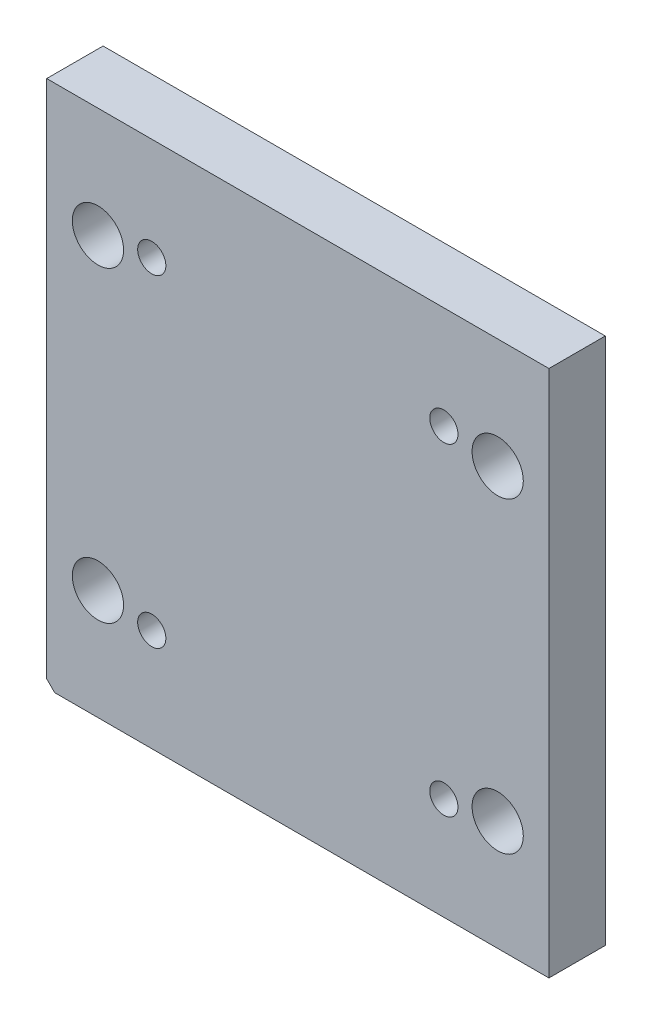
ISO-10303-21;
HEADER;
FILE_DESCRIPTION(('STEP AP214'),'2;1');
FILE_NAME('part.step','',(''),(''),'','','');
FILE_SCHEMA(('AUTOMOTIVE_DESIGN { 1 0 10303 214 1 1 1 1 }'));
ENDSEC;
DATA;
#1=APPLICATION_CONTEXT('core data for automotive mechanical design processes');
#2=APPLICATION_PROTOCOL_DEFINITION('international standard','automotive_design',2000,#1);
#3=PRODUCT_CONTEXT('',#1,'mechanical');
#4=PRODUCT('Part','Part','',(#3));
#5=PRODUCT_RELATED_PRODUCT_CATEGORY('part','',(#4));
#6=PRODUCT_DEFINITION_FORMATION('','',#4);
#7=PRODUCT_DEFINITION_CONTEXT('part definition',#1,'design');
#8=PRODUCT_DEFINITION('design','',#6,#7);
#9=PRODUCT_DEFINITION_SHAPE('','',#8);
#10=(LENGTH_UNIT() NAMED_UNIT(*) SI_UNIT(.MILLI.,.METRE.));
#11=(NAMED_UNIT(*) PLANE_ANGLE_UNIT() SI_UNIT($,.RADIAN.));
#12=(NAMED_UNIT(*) SI_UNIT($,.STERADIAN.) SOLID_ANGLE_UNIT());
#13=UNCERTAINTY_MEASURE_WITH_UNIT(LENGTH_MEASURE(1.E-05),#10,'distance_accuracy_value','');
#14=(GEOMETRIC_REPRESENTATION_CONTEXT(3) GLOBAL_UNCERTAINTY_ASSIGNED_CONTEXT((#13)) GLOBAL_UNIT_ASSIGNED_CONTEXT((#10,
#11,#12)) REPRESENTATION_CONTEXT('',''));
#15=CARTESIAN_POINT('',(0.,0.,0.));
#16=DIRECTION('',(0.,0.,1.));
#17=DIRECTION('',(1.,0.,0.));
#18=AXIS2_PLACEMENT_3D('',#15,#16,#17);
#19=CARTESIAN_POINT('',(-98.,-103.,-306.344861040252));
#20=DIRECTION('',(-1.,0.,0.));
#21=DIRECTION('',(0.,0.,1.));
#22=AXIS2_PLACEMENT_3D('',#19,#20,#21);
#23=PLANE('',#22);
#24=DIRECTION('',(0.,1.,0.));
#25=VECTOR('',#24,1.);
#26=CARTESIAN_POINT('',(-98.,-103.,-22.));
#27=LINE('',#26,#25);
#28=CARTESIAN_POINT('',(-98.,-99.88,-22.));
#29=VERTEX_POINT('',#28);
#30=CARTESIAN_POINT('',(-98.,103.,-22.));
#31=VERTEX_POINT('',#30);
#32=EDGE_CURVE('E108',#29,#31,#27,.T.);
#33=ORIENTED_EDGE('',*,*,#32,.F.);
#34=DIRECTION('',(0.,0.,1.));
#35=VECTOR('',#34,1.);
#36=CARTESIAN_POINT('',(-98.,-99.88,-306.344861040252));
#37=LINE('',#36,#35);
#38=CARTESIAN_POINT('',(-98.,-99.88,0.));
#39=VERTEX_POINT('',#38);
#40=EDGE_CURVE('E107',#29,#39,#37,.T.);
#41=ORIENTED_EDGE('',*,*,#40,.T.);
#42=DIRECTION('',(0.,-1.,0.));
#43=VECTOR('',#42,1.);
#44=CARTESIAN_POINT('',(-98.,-103.,0.));
#45=LINE('',#44,#43);
#46=CARTESIAN_POINT('',(-98.,103.,0.));
#47=VERTEX_POINT('',#46);
#48=EDGE_CURVE('E85',#47,#39,#45,.T.);
#49=ORIENTED_EDGE('',*,*,#48,.F.);
#50=DIRECTION('',(0.,0.,1.));
#51=VECTOR('',#50,1.);
#52=CARTESIAN_POINT('',(-98.,103.,-306.344861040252));
#53=LINE('',#52,#51);
#54=EDGE_CURVE('E102',#31,#47,#53,.T.);
#55=ORIENTED_EDGE('',*,*,#54,.F.);
#56=EDGE_LOOP('',(#33,#41,#49,#55));
#57=FACE_BOUND('',#56,.T.);
#58=ADVANCED_FACE('F34',(#57),#23,.T.);
#59=CARTESIAN_POINT('',(-98.,103.,-306.344861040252));
#60=DIRECTION('',(0.,1.,0.));
#61=DIRECTION('',(-1.,0.,0.));
#62=AXIS2_PLACEMENT_3D('',#59,#60,#61);
#63=PLANE('',#62);
#64=DIRECTION('',(1.,0.,0.));
#65=VECTOR('',#64,1.);
#66=CARTESIAN_POINT('',(-98.,103.,-22.));
#67=LINE('',#66,#65);
#68=CARTESIAN_POINT('',(98.,103.,-22.));
#69=VERTEX_POINT('',#68);
#70=EDGE_CURVE('E124',#31,#69,#67,.T.);
#71=ORIENTED_EDGE('',*,*,#70,.F.);
#72=ORIENTED_EDGE('',*,*,#54,.T.);
#73=DIRECTION('',(-1.,0.,0.));
#74=VECTOR('',#73,1.);
#75=CARTESIAN_POINT('',(-98.,103.,0.));
#76=LINE('',#75,#74);
#77=CARTESIAN_POINT('',(98.,103.,0.));
#78=VERTEX_POINT('',#77);
#79=EDGE_CURVE('E94',#78,#47,#76,.T.);
#80=ORIENTED_EDGE('',*,*,#79,.F.);
#81=DIRECTION('',(0.,0.,1.));
#82=VECTOR('',#81,1.);
#83=CARTESIAN_POINT('',(98.,103.,-306.344861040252));
#84=LINE('',#83,#82);
#85=EDGE_CURVE('E93',#69,#78,#84,.T.);
#86=ORIENTED_EDGE('',*,*,#85,.F.);
#87=EDGE_LOOP('',(#71,#72,#80,#86));
#88=FACE_BOUND('',#87,.T.);
#89=ADVANCED_FACE('F225',(#88),#63,.T.);
#90=CARTESIAN_POINT('',(98.,-103.,-306.344861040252));
#91=DIRECTION('',(1.,0.,0.));
#92=DIRECTION('',(0.,1.,0.));
#93=AXIS2_PLACEMENT_3D('',#90,#91,#92);
#94=PLANE('',#93);
#95=DIRECTION('',(0.,-1.,0.));
#96=VECTOR('',#95,1.);
#97=CARTESIAN_POINT('',(98.,-103.,-22.));
#98=LINE('',#97,#96);
#99=CARTESIAN_POINT('',(98.,-103.,-22.));
#100=VERTEX_POINT('',#99);
#101=EDGE_CURVE('E104',#69,#100,#98,.T.);
#102=ORIENTED_EDGE('',*,*,#101,.F.);
#103=ORIENTED_EDGE('',*,*,#85,.T.);
#104=DIRECTION('',(0.,1.,0.));
#105=VECTOR('',#104,1.);
#106=CARTESIAN_POINT('',(98.,-103.,0.));
#107=LINE('',#106,#105);
#108=CARTESIAN_POINT('',(98.,-103.,0.));
#109=VERTEX_POINT('',#108);
#110=EDGE_CURVE('E83',#109,#78,#107,.T.);
#111=ORIENTED_EDGE('',*,*,#110,.F.);
#112=DIRECTION('',(0.,0.,1.));
#113=VECTOR('',#112,1.);
#114=CARTESIAN_POINT('',(98.,-103.,-306.344861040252));
#115=LINE('',#114,#113);
#116=EDGE_CURVE('E88',#100,#109,#115,.T.);
#117=ORIENTED_EDGE('',*,*,#116,.F.);
#118=EDGE_LOOP('',(#102,#103,#111,#117));
#119=FACE_BOUND('',#118,.T.);
#120=ADVANCED_FACE('F96',(#119),#94,.T.);
#121=CARTESIAN_POINT('',(-98.,-103.,-306.344861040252));
#122=DIRECTION('',(0.,-1.,0.));
#123=DIRECTION('',(1.,0.,0.));
#124=AXIS2_PLACEMENT_3D('',#121,#122,#123);
#125=PLANE('',#124);
#126=DIRECTION('',(1.,0.,0.));
#127=VECTOR('',#126,1.);
#128=CARTESIAN_POINT('',(-98.,-103.,0.));
#129=LINE('',#128,#127);
#130=CARTESIAN_POINT('',(-94.88,-103.,0.));
#131=VERTEX_POINT('',#130);
#132=EDGE_CURVE('E78',#131,#109,#129,.T.);
#133=ORIENTED_EDGE('',*,*,#132,.F.);
#134=DIRECTION('',(0.,0.,-1.));
#135=VECTOR('',#134,1.);
#136=CARTESIAN_POINT('',(-94.88,-103.,-306.344861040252));
#137=LINE('',#136,#135);
#138=CARTESIAN_POINT('',(-94.88,-103.,-22.));
#139=VERTEX_POINT('',#138);
#140=EDGE_CURVE('E42',#131,#139,#137,.T.);
#141=ORIENTED_EDGE('',*,*,#140,.T.);
#142=DIRECTION('',(-1.,0.,0.));
#143=VECTOR('',#142,1.);
#144=CARTESIAN_POINT('',(-98.,-103.,-22.));
#145=LINE('',#144,#143);
#146=EDGE_CURVE('E90',#100,#139,#145,.T.);
#147=ORIENTED_EDGE('',*,*,#146,.F.);
#148=ORIENTED_EDGE('',*,*,#116,.T.);
#149=EDGE_LOOP('',(#133,#141,#147,#148));
#150=FACE_BOUND('',#149,.T.);
#151=ADVANCED_FACE('F89',(#150),#125,.T.);
#152=CARTESIAN_POINT('',(0.,0.,0.));
#153=DIRECTION('',(0.,0.,-1.));
#154=DIRECTION('',(-1.,0.,0.));
#155=AXIS2_PLACEMENT_3D('',#152,#153,#154);
#156=PLANE('',#155);
#157=CARTESIAN_POINT('',(-57.,-63.,0.));
#158=DIRECTION('',(0.,0.,-1.));
#159=DIRECTION('',(-1.,0.,0.));
#160=AXIS2_PLACEMENT_3D('',#157,#158,#159);
#161=CIRCLE('',#160,5.5);
#162=CARTESIAN_POINT('',(-62.5,-63.,0.));
#163=VERTEX_POINT('',#162);
#164=EDGE_CURVE('E183',#163,#163,#161,.T.);
#165=ORIENTED_EDGE('',*,*,#164,.T.);
#166=EDGE_LOOP('',(#165));
#167=FACE_BOUND('',#166,.T.);
#168=CARTESIAN_POINT('',(-57.,63.,0.));
#169=DIRECTION('',(0.,0.,-1.));
#170=DIRECTION('',(-1.,0.,0.));
#171=AXIS2_PLACEMENT_3D('',#168,#169,#170);
#172=CIRCLE('',#171,5.5);
#173=CARTESIAN_POINT('',(-62.5,63.,0.));
#174=VERTEX_POINT('',#173);
#175=EDGE_CURVE('E171',#174,#174,#172,.T.);
#176=ORIENTED_EDGE('',*,*,#175,.T.);
#177=EDGE_LOOP('',(#176));
#178=FACE_BOUND('',#177,.T.);
#179=CARTESIAN_POINT('',(57.,63.,0.));
#180=DIRECTION('',(0.,0.,-1.));
#181=DIRECTION('',(-1.,0.,0.));
#182=AXIS2_PLACEMENT_3D('',#179,#180,#181);
#183=CIRCLE('',#182,5.5);
#184=CARTESIAN_POINT('',(51.5,63.,0.));
#185=VERTEX_POINT('',#184);
#186=EDGE_CURVE('E159',#185,#185,#183,.T.);
#187=ORIENTED_EDGE('',*,*,#186,.T.);
#188=EDGE_LOOP('',(#187));
#189=FACE_BOUND('',#188,.T.);
#190=CARTESIAN_POINT('',(57.,-63.,0.));
#191=DIRECTION('',(0.,0.,-1.));
#192=DIRECTION('',(-1.,0.,0.));
#193=AXIS2_PLACEMENT_3D('',#190,#191,#192);
#194=CIRCLE('',#193,5.50000000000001);
#195=CARTESIAN_POINT('',(51.5,-63.,0.));
#196=VERTEX_POINT('',#195);
#197=EDGE_CURVE('E147',#196,#196,#194,.T.);
#198=ORIENTED_EDGE('',*,*,#197,.T.);
#199=EDGE_LOOP('',(#198));
#200=FACE_BOUND('',#199,.T.);
#201=CARTESIAN_POINT('',(-78.,-60.,0.));
#202=DIRECTION('',(0.,0.,1.));
#203=DIRECTION('',(1.,0.,0.));
#204=AXIS2_PLACEMENT_3D('',#201,#202,#203);
#205=CIRCLE('',#204,9.99999999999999);
#206=CARTESIAN_POINT('',(-68.,-60.,0.));
#207=VERTEX_POINT('',#206);
#208=EDGE_CURVE('E144',#207,#207,#205,.T.);
#209=ORIENTED_EDGE('',*,*,#208,.F.);
#210=EDGE_LOOP('',(#209));
#211=FACE_BOUND('',#210,.T.);
#212=CARTESIAN_POINT('',(-78.,60.,0.));
#213=DIRECTION('',(0.,0.,1.));
#214=DIRECTION('',(1.,0.,0.));
#215=AXIS2_PLACEMENT_3D('',#212,#213,#214);
#216=CIRCLE('',#215,9.99999999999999);
#217=CARTESIAN_POINT('',(-68.,60.,0.));
#218=VERTEX_POINT('',#217);
#219=EDGE_CURVE('E138',#218,#218,#216,.T.);
#220=ORIENTED_EDGE('',*,*,#219,.F.);
#221=EDGE_LOOP('',(#220));
#222=FACE_BOUND('',#221,.T.);
#223=CARTESIAN_POINT('',(78.,60.,0.));
#224=DIRECTION('',(0.,0.,1.));
#225=DIRECTION('',(1.,0.,0.));
#226=AXIS2_PLACEMENT_3D('',#223,#224,#225);
#227=CIRCLE('',#226,9.99999999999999);
#228=CARTESIAN_POINT('',(88.,60.,0.));
#229=VERTEX_POINT('',#228);
#230=EDGE_CURVE('E132',#229,#229,#227,.T.);
#231=ORIENTED_EDGE('',*,*,#230,.F.);
#232=EDGE_LOOP('',(#231));
#233=FACE_BOUND('',#232,.T.);
#234=CARTESIAN_POINT('',(78.,-60.,0.));
#235=DIRECTION('',(0.,0.,1.));
#236=DIRECTION('',(1.,0.,0.));
#237=AXIS2_PLACEMENT_3D('',#234,#235,#236);
#238=CIRCLE('',#237,9.99999999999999);
#239=CARTESIAN_POINT('',(88.,-60.,0.));
#240=VERTEX_POINT('',#239);
#241=EDGE_CURVE('E120',#240,#240,#238,.T.);
#242=ORIENTED_EDGE('',*,*,#241,.F.);
#243=EDGE_LOOP('',(#242));
#244=FACE_BOUND('',#243,.T.);
#245=ORIENTED_EDGE('',*,*,#48,.T.);
#246=DIRECTION('',(-0.707106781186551,0.707106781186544,0.));
#247=VECTOR('',#246,1.);
#248=CARTESIAN_POINT('',(-98.,-99.88,0.));
#249=LINE('',#248,#247);
#250=EDGE_CURVE('E56',#39,#131,#249,.F.);
#251=ORIENTED_EDGE('',*,*,#250,.T.);
#252=ORIENTED_EDGE('',*,*,#132,.T.);
#253=ORIENTED_EDGE('',*,*,#110,.T.);
#254=ORIENTED_EDGE('',*,*,#79,.T.);
#255=EDGE_LOOP('',(#245,#251,#252,#253,#254));
#256=FACE_BOUND('',#255,.T.);
#257=ADVANCED_FACE('F80',(#167,#178,#189,#200,#211,#222,#233,#244,#256),#156,.F.);
#258=CARTESIAN_POINT('',(0.,0.,-22.));
#259=DIRECTION('',(0.,0.,1.));
#260=DIRECTION('',(1.,0.,0.));
#261=AXIS2_PLACEMENT_3D('',#258,#259,#260);
#262=PLANE('',#261);
#263=CARTESIAN_POINT('',(-57.,-63.,-22.));
#264=DIRECTION('',(0.,0.,-1.));
#265=DIRECTION('',(-1.,0.,0.));
#266=AXIS2_PLACEMENT_3D('',#263,#264,#265);
#267=CIRCLE('',#266,9.);
#268=CARTESIAN_POINT('',(-66.,-63.,-22.));
#269=VERTEX_POINT('',#268);
#270=EDGE_CURVE('E192',#269,#269,#267,.T.);
#271=ORIENTED_EDGE('',*,*,#270,.F.);
#272=EDGE_LOOP('',(#271));
#273=FACE_BOUND('',#272,.T.);
#274=CARTESIAN_POINT('',(-57.,63.,-22.));
#275=DIRECTION('',(0.,0.,-1.));
#276=DIRECTION('',(-1.,0.,0.));
#277=AXIS2_PLACEMENT_3D('',#274,#275,#276);
#278=CIRCLE('',#277,9.);
#279=CARTESIAN_POINT('',(-66.,63.,-22.));
#280=VERTEX_POINT('',#279);
#281=EDGE_CURVE('E180',#280,#280,#278,.T.);
#282=ORIENTED_EDGE('',*,*,#281,.F.);
#283=EDGE_LOOP('',(#282));
#284=FACE_BOUND('',#283,.T.);
#285=CARTESIAN_POINT('',(57.,63.,-22.));
#286=DIRECTION('',(0.,0.,-1.));
#287=DIRECTION('',(-1.,0.,0.));
#288=AXIS2_PLACEMENT_3D('',#285,#286,#287);
#289=CIRCLE('',#288,9.00000000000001);
#290=CARTESIAN_POINT('',(48.,63.,-22.));
#291=VERTEX_POINT('',#290);
#292=EDGE_CURVE('E168',#291,#291,#289,.T.);
#293=ORIENTED_EDGE('',*,*,#292,.F.);
#294=EDGE_LOOP('',(#293));
#295=FACE_BOUND('',#294,.T.);
#296=CARTESIAN_POINT('',(57.,-63.,-22.));
#297=DIRECTION('',(0.,0.,-1.));
#298=DIRECTION('',(-1.,0.,0.));
#299=AXIS2_PLACEMENT_3D('',#296,#297,#298);
#300=CIRCLE('',#299,9.00000000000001);
#301=CARTESIAN_POINT('',(48.,-63.,-22.));
#302=VERTEX_POINT('',#301);
#303=EDGE_CURVE('E156',#302,#302,#300,.T.);
#304=ORIENTED_EDGE('',*,*,#303,.F.);
#305=EDGE_LOOP('',(#304));
#306=FACE_BOUND('',#305,.T.);
#307=CARTESIAN_POINT('',(-78.,-60.,-22.));
#308=DIRECTION('',(0.,0.,1.));
#309=DIRECTION('',(1.,0.,0.));
#310=AXIS2_PLACEMENT_3D('',#307,#308,#309);
#311=CIRCLE('',#310,9.99999999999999);
#312=CARTESIAN_POINT('',(-68.,-60.,-22.));
#313=VERTEX_POINT('',#312);
#314=EDGE_CURVE('E141',#313,#313,#311,.T.);
#315=ORIENTED_EDGE('',*,*,#314,.T.);
#316=EDGE_LOOP('',(#315));
#317=FACE_BOUND('',#316,.T.);
#318=CARTESIAN_POINT('',(-78.,60.,-22.));
#319=DIRECTION('',(0.,0.,1.));
#320=DIRECTION('',(1.,0.,0.));
#321=AXIS2_PLACEMENT_3D('',#318,#319,#320);
#322=CIRCLE('',#321,9.99999999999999);
#323=CARTESIAN_POINT('',(-68.,60.,-22.));
#324=VERTEX_POINT('',#323);
#325=EDGE_CURVE('E135',#324,#324,#322,.T.);
#326=ORIENTED_EDGE('',*,*,#325,.T.);
#327=EDGE_LOOP('',(#326));
#328=FACE_BOUND('',#327,.T.);
#329=CARTESIAN_POINT('',(78.,60.,-22.));
#330=DIRECTION('',(0.,0.,1.));
#331=DIRECTION('',(1.,0.,0.));
#332=AXIS2_PLACEMENT_3D('',#329,#330,#331);
#333=CIRCLE('',#332,9.99999999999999);
#334=CARTESIAN_POINT('',(88.,60.,-22.));
#335=VERTEX_POINT('',#334);
#336=EDGE_CURVE('E129',#335,#335,#333,.T.);
#337=ORIENTED_EDGE('',*,*,#336,.T.);
#338=EDGE_LOOP('',(#337));
#339=FACE_BOUND('',#338,.T.);
#340=CARTESIAN_POINT('',(78.,-60.,-22.));
#341=DIRECTION('',(0.,0.,1.));
#342=DIRECTION('',(1.,0.,0.));
#343=AXIS2_PLACEMENT_3D('',#340,#341,#342);
#344=CIRCLE('',#343,9.99999999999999);
#345=CARTESIAN_POINT('',(88.,-60.,-22.));
#346=VERTEX_POINT('',#345);
#347=EDGE_CURVE('E118',#346,#346,#344,.T.);
#348=ORIENTED_EDGE('',*,*,#347,.T.);
#349=EDGE_LOOP('',(#348));
#350=FACE_BOUND('',#349,.T.);
#351=ORIENTED_EDGE('',*,*,#146,.T.);
#352=DIRECTION('',(0.707106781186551,-0.707106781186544,0.));
#353=VECTOR('',#352,1.);
#354=CARTESIAN_POINT('',(-98.,-99.88,-22.));
#355=LINE('',#354,#353);
#356=EDGE_CURVE('E11',#139,#29,#355,.F.);
#357=ORIENTED_EDGE('',*,*,#356,.T.);
#358=ORIENTED_EDGE('',*,*,#32,.T.);
#359=ORIENTED_EDGE('',*,*,#70,.T.);
#360=ORIENTED_EDGE('',*,*,#101,.T.);
#361=EDGE_LOOP('',(#351,#357,#358,#359,#360));
#362=FACE_BOUND('',#361,.T.);
#363=ADVANCED_FACE('F198',(#273,#284,#295,#306,#317,#328,#339,#350,#362),#262,.F.);
#364=CARTESIAN_POINT('',(78.,-60.,0.));
#365=DIRECTION('',(0.,0.,1.));
#366=DIRECTION('',(1.,0.,0.));
#367=AXIS2_PLACEMENT_3D('',#364,#365,#366);
#368=CYLINDRICAL_SURFACE('',#367,9.99999999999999);
#369=ORIENTED_EDGE('',*,*,#347,.F.);
#370=EDGE_LOOP('',(#369));
#371=FACE_BOUND('',#370,.T.);
#372=ORIENTED_EDGE('',*,*,#241,.T.);
#373=EDGE_LOOP('',(#372));
#374=FACE_BOUND('',#373,.T.);
#375=ADVANCED_FACE('F201',(#371,#374),#368,.F.);
#376=CARTESIAN_POINT('',(78.,60.,0.));
#377=DIRECTION('',(0.,0.,1.));
#378=DIRECTION('',(1.,0.,0.));
#379=AXIS2_PLACEMENT_3D('',#376,#377,#378);
#380=CYLINDRICAL_SURFACE('',#379,9.99999999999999);
#381=ORIENTED_EDGE('',*,*,#336,.F.);
#382=EDGE_LOOP('',(#381));
#383=FACE_BOUND('',#382,.T.);
#384=ORIENTED_EDGE('',*,*,#230,.T.);
#385=EDGE_LOOP('',(#384));
#386=FACE_BOUND('',#385,.T.);
#387=ADVANCED_FACE('F241',(#383,#386),#380,.F.);
#388=CARTESIAN_POINT('',(-78.,60.,0.));
#389=DIRECTION('',(0.,0.,1.));
#390=DIRECTION('',(1.,0.,0.));
#391=AXIS2_PLACEMENT_3D('',#388,#389,#390);
#392=CYLINDRICAL_SURFACE('',#391,9.99999999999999);
#393=ORIENTED_EDGE('',*,*,#325,.F.);
#394=EDGE_LOOP('',(#393));
#395=FACE_BOUND('',#394,.T.);
#396=ORIENTED_EDGE('',*,*,#219,.T.);
#397=EDGE_LOOP('',(#396));
#398=FACE_BOUND('',#397,.T.);
#399=ADVANCED_FACE('F245',(#395,#398),#392,.F.);
#400=CARTESIAN_POINT('',(-78.,-60.,0.));
#401=DIRECTION('',(0.,0.,1.));
#402=DIRECTION('',(1.,0.,0.));
#403=AXIS2_PLACEMENT_3D('',#400,#401,#402);
#404=CYLINDRICAL_SURFACE('',#403,9.99999999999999);
#405=ORIENTED_EDGE('',*,*,#314,.F.);
#406=EDGE_LOOP('',(#405));
#407=FACE_BOUND('',#406,.T.);
#408=ORIENTED_EDGE('',*,*,#208,.T.);
#409=EDGE_LOOP('',(#408));
#410=FACE_BOUND('',#409,.T.);
#411=ADVANCED_FACE('F249',(#407,#410),#404,.F.);
#412=CARTESIAN_POINT('',(57.,-63.,-22.));
#413=DIRECTION('',(0.,0.,-1.));
#414=DIRECTION('',(-1.,0.,0.));
#415=AXIS2_PLACEMENT_3D('',#412,#413,#414);
#416=CYLINDRICAL_SURFACE('',#415,5.50000000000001);
#417=ORIENTED_EDGE('',*,*,#197,.F.);
#418=EDGE_LOOP('',(#417));
#419=FACE_BOUND('',#418,.T.);
#420=CARTESIAN_POINT('',(57.,-63.,-9.));
#421=DIRECTION('',(0.,0.,-1.));
#422=DIRECTION('',(-1.,0.,0.));
#423=AXIS2_PLACEMENT_3D('',#420,#421,#422);
#424=CIRCLE('',#423,5.50000000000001);
#425=CARTESIAN_POINT('',(51.5,-63.,-9.));
#426=VERTEX_POINT('',#425);
#427=EDGE_CURVE('E150',#426,#426,#424,.T.);
#428=ORIENTED_EDGE('',*,*,#427,.T.);
#429=EDGE_LOOP('',(#428));
#430=FACE_BOUND('',#429,.T.);
#431=ADVANCED_FACE('F253',(#419,#430),#416,.F.);
#432=CARTESIAN_POINT('',(62.5,-63.,-9.));
#433=DIRECTION('',(0.,0.,1.));
#434=DIRECTION('',(1.,0.,0.));
#435=AXIS2_PLACEMENT_3D('',#432,#433,#434);
#436=PLANE('',#435);
#437=ORIENTED_EDGE('',*,*,#427,.F.);
#438=EDGE_LOOP('',(#437));
#439=FACE_BOUND('',#438,.T.);
#440=CARTESIAN_POINT('',(57.,-63.,-9.));
#441=DIRECTION('',(0.,0.,-1.));
#442=DIRECTION('',(-1.,0.,0.));
#443=AXIS2_PLACEMENT_3D('',#440,#441,#442);
#444=CIRCLE('',#443,8.99999999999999);
#445=CARTESIAN_POINT('',(48.,-63.,-9.));
#446=VERTEX_POINT('',#445);
#447=EDGE_CURVE('E153',#446,#446,#444,.T.);
#448=ORIENTED_EDGE('',*,*,#447,.T.);
#449=EDGE_LOOP('',(#448));
#450=FACE_BOUND('',#449,.T.);
#451=ADVANCED_FACE('F257',(#439,#450),#436,.F.);
#452=CARTESIAN_POINT('',(57.,-63.,-22.));
#453=DIRECTION('',(0.,0.,-1.));
#454=DIRECTION('',(-1.,0.,0.));
#455=AXIS2_PLACEMENT_3D('',#452,#453,#454);
#456=CYLINDRICAL_SURFACE('',#455,9.);
#457=ORIENTED_EDGE('',*,*,#447,.F.);
#458=EDGE_LOOP('',(#457));
#459=FACE_BOUND('',#458,.T.);
#460=ORIENTED_EDGE('',*,*,#303,.T.);
#461=EDGE_LOOP('',(#460));
#462=FACE_BOUND('',#461,.T.);
#463=ADVANCED_FACE('F261',(#459,#462),#456,.F.);
#464=CARTESIAN_POINT('',(57.,63.,-22.));
#465=DIRECTION('',(0.,0.,-1.));
#466=DIRECTION('',(-1.,0.,0.));
#467=AXIS2_PLACEMENT_3D('',#464,#465,#466);
#468=CYLINDRICAL_SURFACE('',#467,5.5);
#469=ORIENTED_EDGE('',*,*,#186,.F.);
#470=EDGE_LOOP('',(#469));
#471=FACE_BOUND('',#470,.T.);
#472=CARTESIAN_POINT('',(57.,63.,-9.));
#473=DIRECTION('',(0.,0.,-1.));
#474=DIRECTION('',(-1.,0.,0.));
#475=AXIS2_PLACEMENT_3D('',#472,#473,#474);
#476=CIRCLE('',#475,5.5);
#477=CARTESIAN_POINT('',(51.5,63.,-9.));
#478=VERTEX_POINT('',#477);
#479=EDGE_CURVE('E162',#478,#478,#476,.T.);
#480=ORIENTED_EDGE('',*,*,#479,.T.);
#481=EDGE_LOOP('',(#480));
#482=FACE_BOUND('',#481,.T.);
#483=ADVANCED_FACE('F265',(#471,#482),#468,.F.);
#484=CARTESIAN_POINT('',(62.5,63.,-9.));
#485=DIRECTION('',(0.,0.,1.));
#486=DIRECTION('',(1.,0.,0.));
#487=AXIS2_PLACEMENT_3D('',#484,#485,#486);
#488=PLANE('',#487);
#489=ORIENTED_EDGE('',*,*,#479,.F.);
#490=EDGE_LOOP('',(#489));
#491=FACE_BOUND('',#490,.T.);
#492=CARTESIAN_POINT('',(57.,63.,-9.));
#493=DIRECTION('',(0.,0.,-1.));
#494=DIRECTION('',(-1.,0.,0.));
#495=AXIS2_PLACEMENT_3D('',#492,#493,#494);
#496=CIRCLE('',#495,9.00000000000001);
#497=CARTESIAN_POINT('',(48.,63.,-9.));
#498=VERTEX_POINT('',#497);
#499=EDGE_CURVE('E165',#498,#498,#496,.T.);
#500=ORIENTED_EDGE('',*,*,#499,.T.);
#501=EDGE_LOOP('',(#500));
#502=FACE_BOUND('',#501,.T.);
#503=ADVANCED_FACE('F269',(#491,#502),#488,.F.);
#504=CARTESIAN_POINT('',(57.,63.,-22.));
#505=DIRECTION('',(0.,0.,-1.));
#506=DIRECTION('',(-1.,0.,0.));
#507=AXIS2_PLACEMENT_3D('',#504,#505,#506);
#508=CYLINDRICAL_SURFACE('',#507,9.00000000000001);
#509=ORIENTED_EDGE('',*,*,#499,.F.);
#510=EDGE_LOOP('',(#509));
#511=FACE_BOUND('',#510,.T.);
#512=ORIENTED_EDGE('',*,*,#292,.T.);
#513=EDGE_LOOP('',(#512));
#514=FACE_BOUND('',#513,.T.);
#515=ADVANCED_FACE('F273',(#511,#514),#508,.F.);
#516=CARTESIAN_POINT('',(-57.,63.,-22.));
#517=DIRECTION('',(0.,0.,-1.));
#518=DIRECTION('',(-1.,0.,0.));
#519=AXIS2_PLACEMENT_3D('',#516,#517,#518);
#520=CYLINDRICAL_SURFACE('',#519,5.5);
#521=ORIENTED_EDGE('',*,*,#175,.F.);
#522=EDGE_LOOP('',(#521));
#523=FACE_BOUND('',#522,.T.);
#524=CARTESIAN_POINT('',(-57.,63.,-9.));
#525=DIRECTION('',(0.,0.,-1.));
#526=DIRECTION('',(-1.,0.,0.));
#527=AXIS2_PLACEMENT_3D('',#524,#525,#526);
#528=CIRCLE('',#527,5.5);
#529=CARTESIAN_POINT('',(-62.5,63.,-9.));
#530=VERTEX_POINT('',#529);
#531=EDGE_CURVE('E174',#530,#530,#528,.T.);
#532=ORIENTED_EDGE('',*,*,#531,.T.);
#533=EDGE_LOOP('',(#532));
#534=FACE_BOUND('',#533,.T.);
#535=ADVANCED_FACE('F277',(#523,#534),#520,.F.);
#536=CARTESIAN_POINT('',(-51.5,63.,-9.));
#537=DIRECTION('',(0.,0.,1.));
#538=DIRECTION('',(1.,0.,0.));
#539=AXIS2_PLACEMENT_3D('',#536,#537,#538);
#540=PLANE('',#539);
#541=ORIENTED_EDGE('',*,*,#531,.F.);
#542=EDGE_LOOP('',(#541));
#543=FACE_BOUND('',#542,.T.);
#544=CARTESIAN_POINT('',(-57.,63.,-9.));
#545=DIRECTION('',(0.,0.,-1.));
#546=DIRECTION('',(-1.,0.,0.));
#547=AXIS2_PLACEMENT_3D('',#544,#545,#546);
#548=CIRCLE('',#547,9.);
#549=CARTESIAN_POINT('',(-66.,63.,-9.));
#550=VERTEX_POINT('',#549);
#551=EDGE_CURVE('E177',#550,#550,#548,.T.);
#552=ORIENTED_EDGE('',*,*,#551,.T.);
#553=EDGE_LOOP('',(#552));
#554=FACE_BOUND('',#553,.T.);
#555=ADVANCED_FACE('F281',(#543,#554),#540,.F.);
#556=CARTESIAN_POINT('',(-57.,63.,-22.));
#557=DIRECTION('',(0.,0.,-1.));
#558=DIRECTION('',(-1.,0.,0.));
#559=AXIS2_PLACEMENT_3D('',#556,#557,#558);
#560=CYLINDRICAL_SURFACE('',#559,9.);
#561=ORIENTED_EDGE('',*,*,#551,.F.);
#562=EDGE_LOOP('',(#561));
#563=FACE_BOUND('',#562,.T.);
#564=ORIENTED_EDGE('',*,*,#281,.T.);
#565=EDGE_LOOP('',(#564));
#566=FACE_BOUND('',#565,.T.);
#567=ADVANCED_FACE('F285',(#563,#566),#560,.F.);
#568=CARTESIAN_POINT('',(-57.,-63.,-22.));
#569=DIRECTION('',(0.,0.,-1.));
#570=DIRECTION('',(-1.,0.,0.));
#571=AXIS2_PLACEMENT_3D('',#568,#569,#570);
#572=CYLINDRICAL_SURFACE('',#571,5.5);
#573=ORIENTED_EDGE('',*,*,#164,.F.);
#574=EDGE_LOOP('',(#573));
#575=FACE_BOUND('',#574,.T.);
#576=CARTESIAN_POINT('',(-57.,-63.,-9.));
#577=DIRECTION('',(0.,0.,-1.));
#578=DIRECTION('',(-1.,0.,0.));
#579=AXIS2_PLACEMENT_3D('',#576,#577,#578);
#580=CIRCLE('',#579,5.5);
#581=CARTESIAN_POINT('',(-62.5,-63.,-9.));
#582=VERTEX_POINT('',#581);
#583=EDGE_CURVE('E186',#582,#582,#580,.T.);
#584=ORIENTED_EDGE('',*,*,#583,.T.);
#585=EDGE_LOOP('',(#584));
#586=FACE_BOUND('',#585,.T.);
#587=ADVANCED_FACE('F289',(#575,#586),#572,.F.);
#588=CARTESIAN_POINT('',(-51.5,-63.,-9.));
#589=DIRECTION('',(0.,0.,1.));
#590=DIRECTION('',(1.,0.,0.));
#591=AXIS2_PLACEMENT_3D('',#588,#589,#590);
#592=PLANE('',#591);
#593=ORIENTED_EDGE('',*,*,#583,.F.);
#594=EDGE_LOOP('',(#593));
#595=FACE_BOUND('',#594,.T.);
#596=CARTESIAN_POINT('',(-57.,-63.,-9.));
#597=DIRECTION('',(0.,0.,-1.));
#598=DIRECTION('',(-1.,0.,0.));
#599=AXIS2_PLACEMENT_3D('',#596,#597,#598);
#600=CIRCLE('',#599,9.);
#601=CARTESIAN_POINT('',(-66.,-63.,-9.));
#602=VERTEX_POINT('',#601);
#603=EDGE_CURVE('E189',#602,#602,#600,.T.);
#604=ORIENTED_EDGE('',*,*,#603,.T.);
#605=EDGE_LOOP('',(#604));
#606=FACE_BOUND('',#605,.T.);
#607=ADVANCED_FACE('F221',(#595,#606),#592,.F.);
#608=CARTESIAN_POINT('',(-57.,-63.,-22.));
#609=DIRECTION('',(0.,0.,-1.));
#610=DIRECTION('',(-1.,0.,0.));
#611=AXIS2_PLACEMENT_3D('',#608,#609,#610);
#612=CYLINDRICAL_SURFACE('',#611,9.);
#613=ORIENTED_EDGE('',*,*,#603,.F.);
#614=EDGE_LOOP('',(#613));
#615=FACE_BOUND('',#614,.T.);
#616=ORIENTED_EDGE('',*,*,#270,.T.);
#617=EDGE_LOOP('',(#616));
#618=FACE_BOUND('',#617,.T.);
#619=ADVANCED_FACE('F196',(#615,#618),#612,.F.);
#620=CARTESIAN_POINT('',(-98.,-99.88,-306.344861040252));
#621=DIRECTION('',(0.707106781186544,0.707106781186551,0.));
#622=DIRECTION('',(0.,0.,1.));
#623=AXIS2_PLACEMENT_3D('',#620,#621,#622);
#624=PLANE('',#623);
#625=ORIENTED_EDGE('',*,*,#356,.F.);
#626=ORIENTED_EDGE('',*,*,#140,.F.);
#627=ORIENTED_EDGE('',*,*,#250,.F.);
#628=ORIENTED_EDGE('',*,*,#40,.F.);
#629=EDGE_LOOP('',(#625,#626,#627,#628));
#630=FACE_BOUND('',#629,.T.);
#631=ADVANCED_FACE('F36',(#630),#624,.F.);
#632=CLOSED_SHELL('',(#58,#89,#120,#151,#257,#363,#375,#387,#399,#411,#431,#451,#463,#483,#503,
#515,#535,#555,#567,#587,#607,#619,#631));
#633=MANIFOLD_SOLID_BREP('B2',#632);
#634=ADVANCED_BREP_SHAPE_REPRESENTATION('',(#18,#633),#14);
#635=SHAPE_DEFINITION_REPRESENTATION(#9,#634);
ENDSEC;
END-ISO-10303-21;
